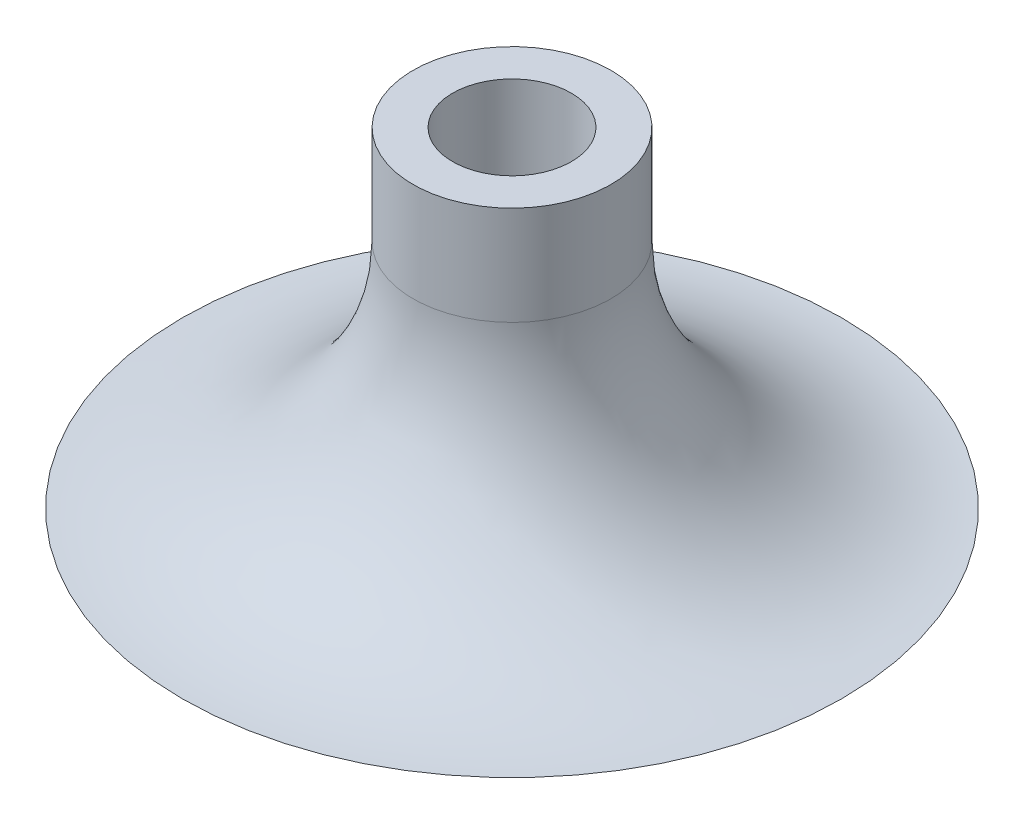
from build123d import *


with BuildPart() as part:
    # Sketch1 → Revolve1 (revolve)
    with BuildSketch(Plane(origin=(0, 0, 0), x_dir=(0, 0, -1), z_dir=(1, 0, 0)), mode=Mode.PRIVATE) as revolve1_sk:
        with BuildLine():
            Line((-12.7, 3.81), (-2.286, 3.81))
            Line((-2.286, 3.81), (-2.286, 16.51))
            Line((-2.286, 16.51), (-3.81, 16.51))
            Line((-3.81, 16.51), (-3.81, 12.7))
            ThreePointArc((-3.81, 12.7), (-6.413820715, 6.413820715), (-12.7, 3.81))
        make_face()
    revolve(revolve1_sk.sketch.rotate(Axis((0, 0, 0), (0, 1, 0)), 180), axis=Axis((0, 0, 0), (0, 1, 0)))


solid = part.part
